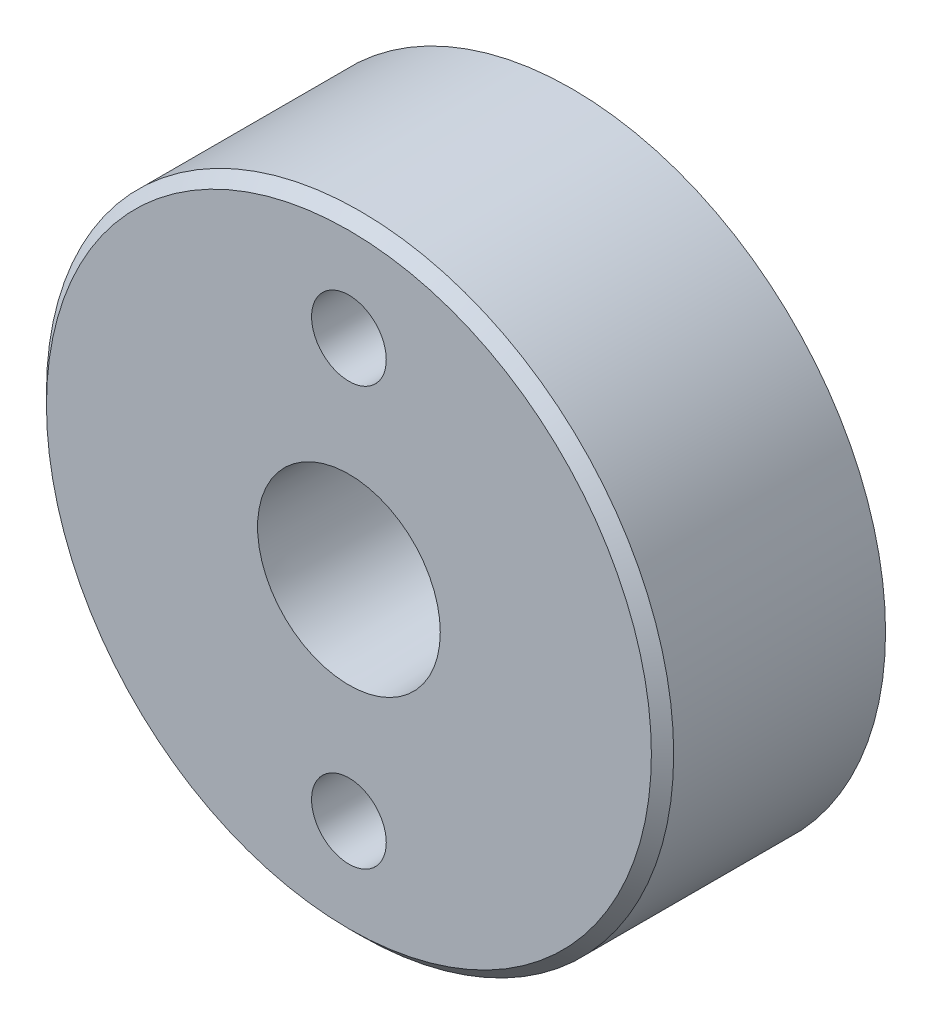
from build123d import *

# Parameters (mm, degrees)
SKETCH1_R         = 21.43125
EXTRUDE1_DEPTH    = 7.62
CIRPATTERN1_COUNT = 2
CHAMFER1_SIZE     = 0.762


with BuildPart() as part:
    # Sketch1 → Extrude1 (new, symmetric)
    with BuildSketch(Plane.XY):
        with Locations(Location((0, 0, 0), (0, 0, 180))):
            Circle(SKETCH1_R)
    extrude(amount=EXTRUDE1_DEPTH, both=True)

    # Sketch2 → 1_4 NPT Tapped Hole1 (revolve, cut)
    with BuildSketch(Plane(origin=(0, 0, 7.62), x_dir=(0, -1, 0), z_dir=(1, 0, 0))):
        Polygon((0, 0), (0, 20.411147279), (5.5626, 17.0688), (5.5626, 10.0203), (5.943679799, 10.0203), (6.243701, 0), align=None)
    revolve(axis=Axis((0, 0, 13.97), (0, 0, -1)), mode=Mode.SUBTRACT)

    # Sketch4 → 7 _0.201_ Diameter Hole1 (revolve, cut)
    with BuildSketch(Plane(origin=(0, 14.2875, 7.62), x_dir=(0, -1, 0), z_dir=(1, 0, 0))):
        Polygon((0, 0), (0, 9.153816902), (2.5527, 7.62), (2.5527, 0), align=None)
    f_7_0_201_diameter_hole1 = revolve(axis=Axis((0, 14.2875, 13.97), (0, 0, -1)), mode=Mode.SUBTRACT)

    # CirPattern1: 7 _0.201_ Diameter Hole1 ×2 about axis
    cirpattern1_axis = Axis((0, 0, 0), (0, 0, 1))
    for i in range(1, CIRPATTERN1_COUNT):
        add(f_7_0_201_diameter_hole1.rotate(cirpattern1_axis, i * 360 / CIRPATTERN1_COUNT), mode=Mode.SUBTRACT)

    # Chamfer1
    chamfer1_edges = [part.edges().sort_by_distance(p)[0] for p in [
        (21.43125, 0, 7.62),
    ]]
    chamfer(chamfer1_edges, length=CHAMFER1_SIZE)


solid = part.part
